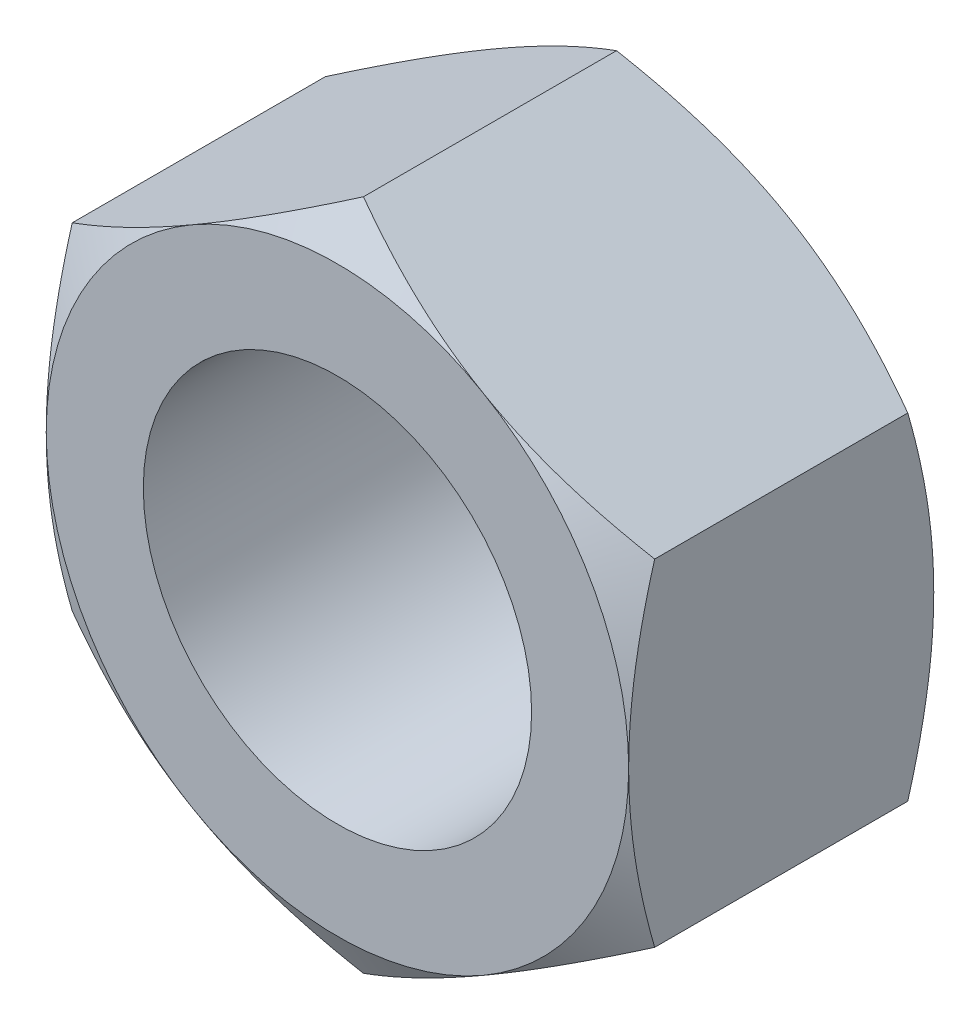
from build123d import *

# Parameters (mm, degrees)
BASE_EXTRUSION_DEPTH    = 11
ESQUISSE3_R             = 7
ENL_V_MAT_EXTRU_1_DEPTH = 20.448650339


with BuildPart() as part:
    # Esquisse1 → Base-Extrusion (new body)
    with BuildSketch(Plane.XY):
        Polygon((10.5, -6.062177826), (10.5, 6.062177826), (0, 12.124355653), (-10.5, 6.062177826), (-10.5, -6.062177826), (0, -12.124355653), align=None)
    extrude(amount=-BASE_EXTRUSION_DEPTH)

    # Esquisse2 → Enl_vement de mati_re-R_volution1 (revolve, cut)
    with BuildSketch(Plane(origin=(0, 0, 0), x_dir=(1, 0, 0), z_dir=(0, 1, 0)), mode=Mode.PRIVATE) as enl_vement_de_mati_re_r_volution1_sk:
        Polygon((-10.5, 0), (-21.026279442, 0), (-21.026279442, 11), (-10.5, 11), (-20.026279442, 5.5), align=None)
    revolve(enl_vement_de_mati_re_r_volution1_sk.sketch.rotate(Axis((0, 0, -11), (0, 0, 1)), 180), axis=Axis((0, 0, -11), (0, 0, 1)), mode=Mode.SUBTRACT)

    # Esquisse3 → Enl_v. mat.-Extru.1 (cut, through all)
    with BuildSketch(Plane.XY):
        Circle(ESQUISSE3_R)
    extrude(amount=-ENL_V_MAT_EXTRU_1_DEPTH, mode=Mode.SUBTRACT)


solid = part.part
